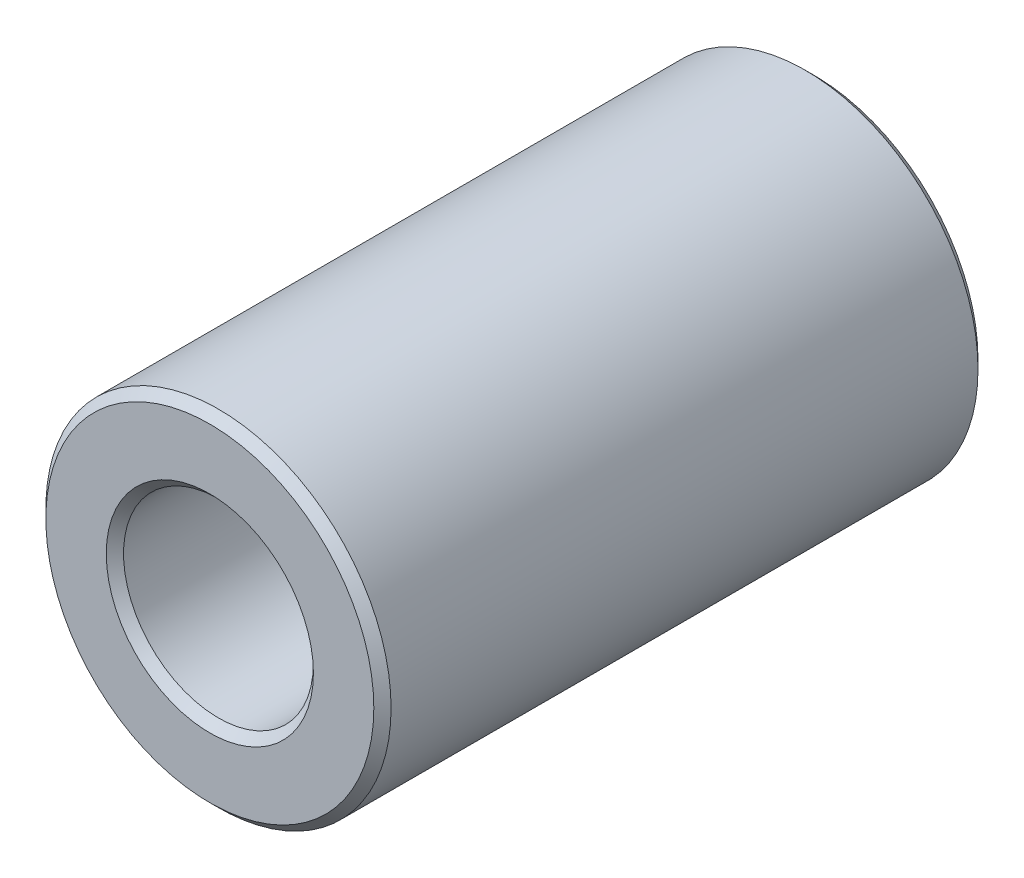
from build123d import *

# Parameters (mm, degrees)
SKETCH1_R           = 2
SKETCH1_R_2         = 1.1
BOSS_EXTRUDE2_DEPTH = 3.5
CHAMFER3_SIZE       = 0.1


with BuildPart() as part:
    # Sketch1 → Boss-Extrude2 (new, symmetric)
    with BuildSketch(Plane.XY):
        Circle(SKETCH1_R)
        Circle(SKETCH1_R_2, mode=Mode.SUBTRACT)
    extrude(amount=BOSS_EXTRUDE2_DEPTH, both=True)

    # Chamfer3
    chamfer3_edges = [part.edges().sort_by_distance(p)[0] for p in [
        (-2, 0, -3.5),
        (-2, 0, 3.5),
        (-1.1, 0, -3.5),
        (-1.1, 0, 3.5),
    ]]
    chamfer(chamfer3_edges, length=CHAMFER3_SIZE)


solid = part.part
